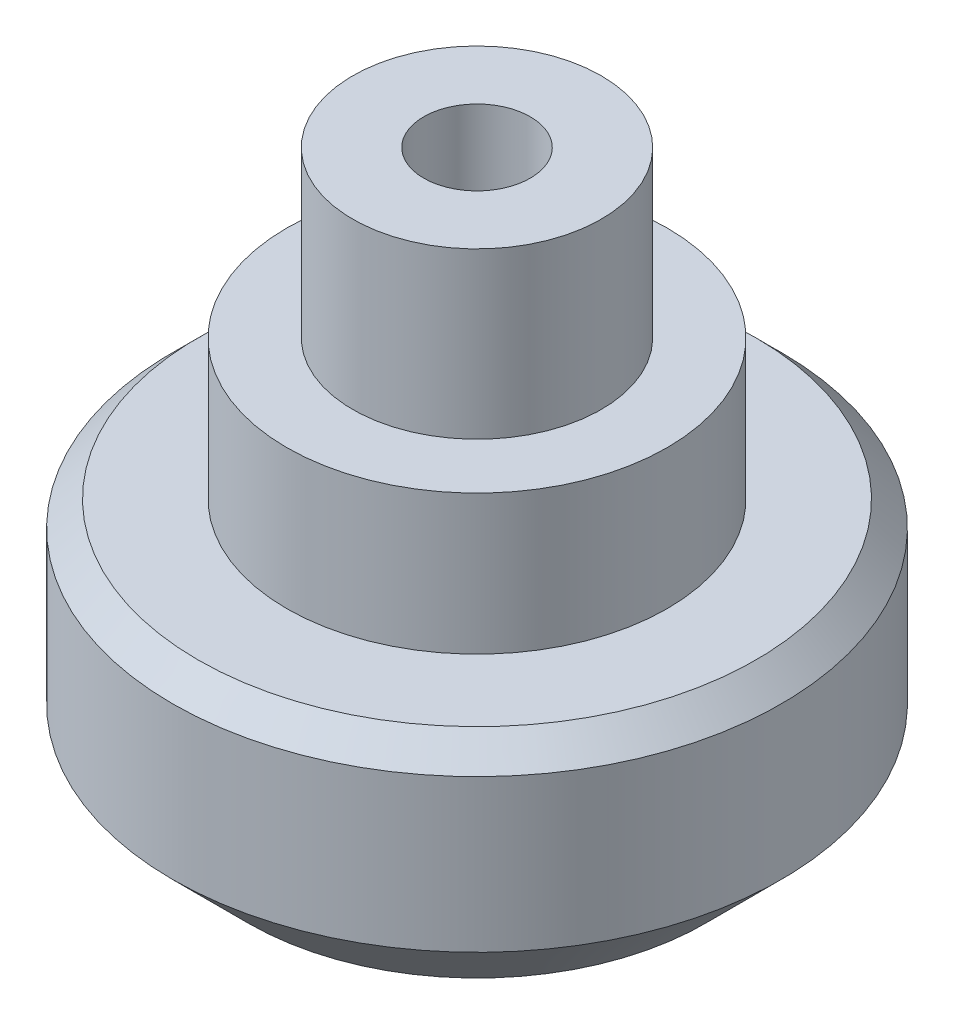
ISO-10303-21;
HEADER;
FILE_DESCRIPTION(('STEP AP214'),'2;1');
FILE_NAME('part.step','',(''),(''),'','','');
FILE_SCHEMA(('AUTOMOTIVE_DESIGN { 1 0 10303 214 1 1 1 1 }'));
ENDSEC;
DATA;
#1=APPLICATION_CONTEXT('core data for automotive mechanical design processes');
#2=APPLICATION_PROTOCOL_DEFINITION('international standard','automotive_design',2000,#1);
#3=PRODUCT_CONTEXT('',#1,'mechanical');
#4=PRODUCT('Part','Part','',(#3));
#5=PRODUCT_RELATED_PRODUCT_CATEGORY('part','',(#4));
#6=PRODUCT_DEFINITION_FORMATION('','',#4);
#7=PRODUCT_DEFINITION_CONTEXT('part definition',#1,'design');
#8=PRODUCT_DEFINITION('design','',#6,#7);
#9=PRODUCT_DEFINITION_SHAPE('','',#8);
#10=(LENGTH_UNIT() NAMED_UNIT(*) SI_UNIT(.MILLI.,.METRE.));
#11=(NAMED_UNIT(*) PLANE_ANGLE_UNIT() SI_UNIT($,.RADIAN.));
#12=(NAMED_UNIT(*) SI_UNIT($,.STERADIAN.) SOLID_ANGLE_UNIT());
#13=UNCERTAINTY_MEASURE_WITH_UNIT(LENGTH_MEASURE(1.E-05),#10,'distance_accuracy_value','');
#14=(GEOMETRIC_REPRESENTATION_CONTEXT(3) GLOBAL_UNCERTAINTY_ASSIGNED_CONTEXT((#13)) GLOBAL_UNIT_ASSIGNED_CONTEXT((#10,
#11,#12)) REPRESENTATION_CONTEXT('',''));
#15=CARTESIAN_POINT('',(0.,0.,0.));
#16=DIRECTION('',(0.,0.,1.));
#17=DIRECTION('',(1.,0.,0.));
#18=AXIS2_PLACEMENT_3D('',#15,#16,#17);
#19=CARTESIAN_POINT('',(0.,15.5,0.));
#20=DIRECTION('',(0.,1.,0.));
#21=DIRECTION('',(0.,0.,1.));
#22=AXIS2_PLACEMENT_3D('',#19,#20,#21);
#23=PLANE('',#22);
#24=CARTESIAN_POINT('',(0.,15.5,0.));
#25=DIRECTION('',(0.,1.,0.));
#26=DIRECTION('',(0.,0.,1.));
#27=AXIS2_PLACEMENT_3D('',#24,#25,#26);
#28=CIRCLE('',#27,7.5);
#29=CARTESIAN_POINT('',(0.,15.5,7.5));
#30=VERTEX_POINT('',#29);
#31=EDGE_CURVE('E48',#30,#30,#28,.T.);
#32=ORIENTED_EDGE('',*,*,#31,.T.);
#33=EDGE_LOOP('',(#32));
#34=FACE_BOUND('',#33,.T.);
#35=CARTESIAN_POINT('',(0.,15.5,0.));
#36=DIRECTION('',(0.,1.,0.));
#37=DIRECTION('',(0.,0.,1.));
#38=AXIS2_PLACEMENT_3D('',#35,#36,#37);
#39=CIRCLE('',#38,4.9);
#40=CARTESIAN_POINT('',(0.,15.5,-4.9));
#41=VERTEX_POINT('',#40);
#42=EDGE_CURVE('E55',#41,#41,#39,.T.);
#43=ORIENTED_EDGE('',*,*,#42,.F.);
#44=EDGE_LOOP('',(#43));
#45=FACE_BOUND('',#44,.T.);
#46=ADVANCED_FACE('F28',(#34,#45),#23,.T.);
#47=CARTESIAN_POINT('',(0.,10.,0.));
#48=DIRECTION('',(0.,1.,0.));
#49=DIRECTION('',(0.,0.,1.));
#50=AXIS2_PLACEMENT_3D('',#47,#48,#49);
#51=PLANE('',#50);
#52=CARTESIAN_POINT('',(0.,10.,0.));
#53=DIRECTION('',(0.,1.,0.));
#54=DIRECTION('',(0.,0.,1.));
#55=AXIS2_PLACEMENT_3D('',#52,#53,#54);
#56=CIRCLE('',#55,11.);
#57=CARTESIAN_POINT('',(0.,10.,11.));
#58=VERTEX_POINT('',#57);
#59=EDGE_CURVE('E43',#58,#58,#56,.T.);
#60=ORIENTED_EDGE('',*,*,#59,.T.);
#61=EDGE_LOOP('',(#60));
#62=FACE_BOUND('',#61,.T.);
#63=CARTESIAN_POINT('',(0.,10.,0.));
#64=DIRECTION('',(0.,1.,0.));
#65=DIRECTION('',(0.,0.,1.));
#66=AXIS2_PLACEMENT_3D('',#63,#64,#65);
#67=CIRCLE('',#66,7.5);
#68=CARTESIAN_POINT('',(0.,10.,7.5));
#69=VERTEX_POINT('',#68);
#70=EDGE_CURVE('E49',#69,#69,#67,.T.);
#71=ORIENTED_EDGE('',*,*,#70,.F.);
#72=EDGE_LOOP('',(#71));
#73=FACE_BOUND('',#72,.T.);
#74=ADVANCED_FACE('F95',(#62,#73),#51,.T.);
#75=CARTESIAN_POINT('',(0.,10.,0.));
#76=DIRECTION('',(0.,-1.,0.));
#77=DIRECTION('',(0.,0.,-1.));
#78=AXIS2_PLACEMENT_3D('',#75,#76,#77);
#79=CYLINDRICAL_SURFACE('',#78,12.);
#80=CARTESIAN_POINT('',(0.,3.,0.));
#81=DIRECTION('',(0.,1.,0.));
#82=DIRECTION('',(0.,0.,1.));
#83=AXIS2_PLACEMENT_3D('',#80,#81,#82);
#84=CIRCLE('',#83,12.);
#85=CARTESIAN_POINT('',(0.,3.,12.));
#86=VERTEX_POINT('',#85);
#87=EDGE_CURVE('E35',#86,#86,#84,.T.);
#88=ORIENTED_EDGE('',*,*,#87,.T.);
#89=EDGE_LOOP('',(#88));
#90=FACE_BOUND('',#89,.T.);
#91=CARTESIAN_POINT('',(0.,9.,0.));
#92=DIRECTION('',(0.,1.,0.));
#93=DIRECTION('',(0.,0.,1.));
#94=AXIS2_PLACEMENT_3D('',#91,#92,#93);
#95=CIRCLE('',#94,12.);
#96=CARTESIAN_POINT('',(0.,9.,12.));
#97=VERTEX_POINT('',#96);
#98=EDGE_CURVE('E39',#97,#97,#95,.F.);
#99=ORIENTED_EDGE('',*,*,#98,.T.);
#100=EDGE_LOOP('',(#99));
#101=FACE_BOUND('',#100,.T.);
#102=ADVANCED_FACE('F86',(#90,#101),#79,.T.);
#103=CARTESIAN_POINT('',(0.,0.,0.));
#104=DIRECTION('',(0.,1.,0.));
#105=DIRECTION('',(0.,0.,1.));
#106=AXIS2_PLACEMENT_3D('',#103,#104,#105);
#107=PLANE('',#106);
#108=CARTESIAN_POINT('',(0.,0.,0.));
#109=DIRECTION('',(0.,1.,0.));
#110=DIRECTION('',(0.,0.,1.));
#111=AXIS2_PLACEMENT_3D('',#108,#109,#110);
#112=CIRCLE('',#111,9.);
#113=CARTESIAN_POINT('',(0.,0.,9.));
#114=VERTEX_POINT('',#113);
#115=EDGE_CURVE('E10',#114,#114,#112,.F.);
#116=ORIENTED_EDGE('',*,*,#115,.T.);
#117=EDGE_LOOP('',(#116));
#118=FACE_BOUND('',#117,.T.);
#119=CARTESIAN_POINT('',(0.,0.,0.));
#120=DIRECTION('',(0.,-1.,0.));
#121=DIRECTION('',(0.,0.,-1.));
#122=AXIS2_PLACEMENT_3D('',#119,#120,#121);
#123=CIRCLE('',#122,2.5);
#124=CARTESIAN_POINT('',(0.,0.,-2.5));
#125=VERTEX_POINT('',#124);
#126=EDGE_CURVE('E67',#125,#125,#123,.T.);
#127=ORIENTED_EDGE('',*,*,#126,.F.);
#128=EDGE_LOOP('',(#127));
#129=FACE_BOUND('',#128,.T.);
#130=ADVANCED_FACE('F83',(#118,#129),#107,.F.);
#131=CARTESIAN_POINT('',(0.,15.5,0.));
#132=DIRECTION('',(0.,-1.,0.));
#133=DIRECTION('',(0.,0.,-1.));
#134=AXIS2_PLACEMENT_3D('',#131,#132,#133);
#135=CYLINDRICAL_SURFACE('',#134,7.5);
#136=ORIENTED_EDGE('',*,*,#31,.F.);
#137=EDGE_LOOP('',(#136));
#138=FACE_BOUND('',#137,.T.);
#139=ORIENTED_EDGE('',*,*,#70,.T.);
#140=EDGE_LOOP('',(#139));
#141=FACE_BOUND('',#140,.T.);
#142=ADVANCED_FACE('F85',(#138,#141),#135,.T.);
#143=CARTESIAN_POINT('',(0.,22.,0.));
#144=DIRECTION('',(0.,-1.,0.));
#145=DIRECTION('',(0.,0.,-1.));
#146=AXIS2_PLACEMENT_3D('',#143,#144,#145);
#147=CYLINDRICAL_SURFACE('',#146,4.9);
#148=CARTESIAN_POINT('',(0.,22.,0.));
#149=DIRECTION('',(0.,1.,0.));
#150=DIRECTION('',(0.,0.,1.));
#151=AXIS2_PLACEMENT_3D('',#148,#149,#150);
#152=CIRCLE('',#151,4.9);
#153=CARTESIAN_POINT('',(0.,22.,-4.9));
#154=VERTEX_POINT('',#153);
#155=EDGE_CURVE('E52',#154,#154,#152,.T.);
#156=CARTESIAN_POINT('',(0.,22.,-4.9));
#157=CARTESIAN_POINT('',(0.,21.9322916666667,-4.9));
#158=CARTESIAN_POINT('',(0.,21.8645833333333,-4.9));
#159=CARTESIAN_POINT('',(0.,21.7291666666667,-4.9));
#160=CARTESIAN_POINT('',(0.,21.6614583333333,-4.9));
#161=CARTESIAN_POINT('',(0.,21.5260416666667,-4.9));
#162=CARTESIAN_POINT('',(0.,21.4583333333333,-4.9));
#163=CARTESIAN_POINT('',(0.,21.3229166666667,-4.9));
#164=CARTESIAN_POINT('',(0.,21.2552083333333,-4.9));
#165=CARTESIAN_POINT('',(0.,21.1197916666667,-4.9));
#166=CARTESIAN_POINT('',(0.,21.0520833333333,-4.9));
#167=CARTESIAN_POINT('',(0.,20.9166666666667,-4.9));
#168=CARTESIAN_POINT('',(0.,20.8489583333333,-4.9));
#169=CARTESIAN_POINT('',(0.,20.7135416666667,-4.9));
#170=CARTESIAN_POINT('',(0.,20.6458333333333,-4.9));
#171=CARTESIAN_POINT('',(0.,20.5104166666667,-4.9));
#172=CARTESIAN_POINT('',(0.,20.4427083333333,-4.9));
#173=CARTESIAN_POINT('',(0.,20.3072916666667,-4.9));
#174=CARTESIAN_POINT('',(0.,20.2395833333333,-4.9));
#175=CARTESIAN_POINT('',(0.,20.1041666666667,-4.9));
#176=CARTESIAN_POINT('',(0.,20.0364583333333,-4.9));
#177=CARTESIAN_POINT('',(0.,19.9010416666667,-4.9));
#178=CARTESIAN_POINT('',(0.,19.8333333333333,-4.9));
#179=CARTESIAN_POINT('',(0.,19.6979166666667,-4.9));
#180=CARTESIAN_POINT('',(0.,19.6302083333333,-4.9));
#181=CARTESIAN_POINT('',(0.,19.4947916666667,-4.9));
#182=CARTESIAN_POINT('',(0.,19.4270833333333,-4.9));
#183=CARTESIAN_POINT('',(0.,19.2916666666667,-4.9));
#184=CARTESIAN_POINT('',(0.,19.2239583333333,-4.9));
#185=CARTESIAN_POINT('',(0.,19.0885416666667,-4.9));
#186=CARTESIAN_POINT('',(0.,19.0208333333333,-4.9));
#187=CARTESIAN_POINT('',(0.,18.8854166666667,-4.9));
#188=CARTESIAN_POINT('',(0.,18.8177083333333,-4.9));
#189=CARTESIAN_POINT('',(0.,18.6822916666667,-4.9));
#190=CARTESIAN_POINT('',(0.,18.6145833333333,-4.9));
#191=CARTESIAN_POINT('',(0.,18.4791666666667,-4.9));
#192=CARTESIAN_POINT('',(0.,18.4114583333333,-4.9));
#193=CARTESIAN_POINT('',(0.,18.2760416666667,-4.9));
#194=CARTESIAN_POINT('',(0.,18.2083333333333,-4.9));
#195=CARTESIAN_POINT('',(0.,18.0729166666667,-4.9));
#196=CARTESIAN_POINT('',(0.,18.0052083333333,-4.9));
#197=CARTESIAN_POINT('',(0.,17.8697916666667,-4.9));
#198=CARTESIAN_POINT('',(0.,17.8020833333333,-4.9));
#199=CARTESIAN_POINT('',(0.,17.6666666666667,-4.9));
#200=CARTESIAN_POINT('',(0.,17.5989583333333,-4.9));
#201=CARTESIAN_POINT('',(0.,17.4635416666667,-4.9));
#202=CARTESIAN_POINT('',(0.,17.3958333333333,-4.9));
#203=CARTESIAN_POINT('',(0.,17.2604166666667,-4.9));
#204=CARTESIAN_POINT('',(0.,17.1927083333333,-4.9));
#205=CARTESIAN_POINT('',(0.,17.0572916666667,-4.9));
#206=CARTESIAN_POINT('',(0.,16.9895833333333,-4.9));
#207=CARTESIAN_POINT('',(0.,16.8541666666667,-4.9));
#208=CARTESIAN_POINT('',(0.,16.7864583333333,-4.9));
#209=CARTESIAN_POINT('',(0.,16.6510416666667,-4.9));
#210=CARTESIAN_POINT('',(0.,16.5833333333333,-4.9));
#211=CARTESIAN_POINT('',(0.,16.4479166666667,-4.9));
#212=CARTESIAN_POINT('',(0.,16.3802083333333,-4.9));
#213=CARTESIAN_POINT('',(0.,16.2447916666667,-4.9));
#214=CARTESIAN_POINT('',(0.,16.1770833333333,-4.9));
#215=CARTESIAN_POINT('',(0.,16.0416666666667,-4.9));
#216=CARTESIAN_POINT('',(0.,15.9739583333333,-4.9));
#217=CARTESIAN_POINT('',(0.,15.8385416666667,-4.9));
#218=CARTESIAN_POINT('',(0.,15.7708333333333,-4.9));
#219=CARTESIAN_POINT('',(0.,15.6354166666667,-4.9));
#220=CARTESIAN_POINT('',(0.,15.5677083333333,-4.9));
#221=CARTESIAN_POINT('',(0.,15.5,-4.9));
#222=B_SPLINE_CURVE_WITH_KNOTS('',3,(#156,#157,#158,#159,#160,#161,#162,#163,#164,#165,#166,
#167,#168,#169,#170,#171,#172,#173,#174,#175,#176,#177,#178,#179,#180,#181,#182,#183,#184,#185,
#186,#187,#188,#189,#190,#191,#192,#193,#194,#195,#196,#197,#198,#199,#200,#201,#202,#203,#204,
#205,#206,#207,#208,#209,#210,#211,#212,#213,#214,#215,#216,#217,#218,#219,#220,#221),
.UNSPECIFIED.,.F.,.F.,(4,2,2,2,2,2,2,2,2,2,2,2,2,2,2,2,2,2,2,2,2,2,2,2,2,2,2,2,2,2,2,2,4),(0.,
0.203124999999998,0.406249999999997,0.609374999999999,0.812499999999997,1.015625,1.21875,
1.421875,1.625,1.828125,2.03125,2.234375,2.4375,2.640625,2.84375,3.046875,3.25,3.453125,3.65625,
3.859375,4.0625,4.265625,4.46875,4.671875,4.875,5.078125,5.28125,5.484375,5.68749999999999,
5.890625,6.09374999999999,6.296875,6.5),.UNSPECIFIED.);
#223=EDGE_CURVE('BSEAM92',#154,#41,#222,.T.);
#224=ORIENTED_EDGE('',*,*,#155,.F.);
#225=ORIENTED_EDGE('',*,*,#42,.T.);
#226=ORIENTED_EDGE('',*,*,#223,.T.);
#227=ORIENTED_EDGE('',*,*,#223,.F.);
#228=EDGE_LOOP('',(#224,#226,#225,#227));
#229=FACE_BOUND('',#228,.T.);
#230=ADVANCED_FACE('F92',(#229),#147,.T.);
#231=CARTESIAN_POINT('',(0.,22.,0.));
#232=DIRECTION('',(0.,1.,0.));
#233=DIRECTION('',(0.,0.,1.));
#234=AXIS2_PLACEMENT_3D('',#231,#232,#233);
#235=PLANE('',#234);
#236=CARTESIAN_POINT('',(0.,22.,0.));
#237=DIRECTION('',(0.,1.,0.));
#238=DIRECTION('',(0.,0.,1.));
#239=AXIS2_PLACEMENT_3D('',#236,#237,#238);
#240=CIRCLE('',#239,2.1);
#241=CARTESIAN_POINT('',(0.,22.,2.1));
#242=VERTEX_POINT('',#241);
#243=EDGE_CURVE('E58',#242,#242,#240,.T.);
#244=ORIENTED_EDGE('',*,*,#243,.F.);
#245=EDGE_LOOP('',(#244));
#246=FACE_BOUND('',#245,.T.);
#247=ORIENTED_EDGE('',*,*,#155,.T.);
#248=EDGE_LOOP('',(#247));
#249=FACE_BOUND('',#248,.T.);
#250=ADVANCED_FACE('F109',(#246,#249),#235,.T.);
#251=CARTESIAN_POINT('',(0.,10.,0.));
#252=DIRECTION('',(0.,1.,0.));
#253=DIRECTION('',(0.,0.,1.));
#254=AXIS2_PLACEMENT_3D('',#251,#252,#253);
#255=CYLINDRICAL_SURFACE('',#254,2.1);
#256=CARTESIAN_POINT('',(0.,10.,0.));
#257=DIRECTION('',(0.,-1.,0.));
#258=DIRECTION('',(0.,0.,-1.));
#259=AXIS2_PLACEMENT_3D('',#256,#257,#258);
#260=CIRCLE('',#259,2.1);
#261=CARTESIAN_POINT('',(0.,10.,-2.1));
#262=VERTEX_POINT('',#261);
#263=EDGE_CURVE('E63',#262,#262,#260,.F.);
#264=ORIENTED_EDGE('',*,*,#263,.F.);
#265=EDGE_LOOP('',(#264));
#266=FACE_BOUND('',#265,.T.);
#267=ORIENTED_EDGE('',*,*,#243,.T.);
#268=EDGE_LOOP('',(#267));
#269=FACE_BOUND('',#268,.T.);
#270=ADVANCED_FACE('F113',(#266,#269),#255,.F.);
#271=CARTESIAN_POINT('',(0.,10.,0.));
#272=DIRECTION('',(0.,-1.,0.));
#273=DIRECTION('',(0.,0.,-1.));
#274=AXIS2_PLACEMENT_3D('',#271,#272,#273);
#275=PLANE('',#274);
#276=CARTESIAN_POINT('',(0.,10.,0.));
#277=DIRECTION('',(0.,-1.,0.));
#278=DIRECTION('',(0.,0.,-1.));
#279=AXIS2_PLACEMENT_3D('',#276,#277,#278);
#280=CIRCLE('',#279,2.5);
#281=CARTESIAN_POINT('',(0.,10.,-2.5));
#282=VERTEX_POINT('',#281);
#283=EDGE_CURVE('E66',#282,#282,#280,.T.);
#284=ORIENTED_EDGE('',*,*,#283,.T.);
#285=EDGE_LOOP('',(#284));
#286=FACE_BOUND('',#285,.T.);
#287=ORIENTED_EDGE('',*,*,#263,.T.);
#288=EDGE_LOOP('',(#287));
#289=FACE_BOUND('',#288,.T.);
#290=ADVANCED_FACE('F73',(#286,#289),#275,.T.);
#291=CARTESIAN_POINT('',(0.,10.,0.));
#292=DIRECTION('',(0.,-1.,0.));
#293=DIRECTION('',(0.,0.,-1.));
#294=AXIS2_PLACEMENT_3D('',#291,#292,#293);
#295=CYLINDRICAL_SURFACE('',#294,2.5);
#296=ORIENTED_EDGE('',*,*,#283,.F.);
#297=EDGE_LOOP('',(#296));
#298=FACE_BOUND('',#297,.T.);
#299=ORIENTED_EDGE('',*,*,#126,.T.);
#300=EDGE_LOOP('',(#299));
#301=FACE_BOUND('',#300,.T.);
#302=ADVANCED_FACE('F76',(#298,#301),#295,.F.);
#303=CARTESIAN_POINT('',(0.,10.,0.));
#304=DIRECTION('',(0.,-1.,0.));
#305=DIRECTION('',(0.,0.,-1.));
#306=AXIS2_PLACEMENT_3D('',#303,#304,#305);
#307=CONICAL_SURFACE('',#306,11.,0.785398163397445);
#308=ORIENTED_EDGE('',*,*,#98,.F.);
#309=EDGE_LOOP('',(#308));
#310=FACE_BOUND('',#309,.T.);
#311=ORIENTED_EDGE('',*,*,#59,.F.);
#312=EDGE_LOOP('',(#311));
#313=FACE_BOUND('',#312,.T.);
#314=ADVANCED_FACE('F79',(#310,#313),#307,.T.);
#315=CARTESIAN_POINT('',(0.,3.,0.));
#316=DIRECTION('',(0.,1.,0.));
#317=DIRECTION('',(0.,0.,1.));
#318=AXIS2_PLACEMENT_3D('',#315,#316,#317);
#319=CONICAL_SURFACE('',#318,12.,0.78539816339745);
#320=ORIENTED_EDGE('',*,*,#115,.F.);
#321=EDGE_LOOP('',(#320));
#322=FACE_BOUND('',#321,.T.);
#323=ORIENTED_EDGE('',*,*,#87,.F.);
#324=EDGE_LOOP('',(#323));
#325=FACE_BOUND('',#324,.T.);
#326=ADVANCED_FACE('F30',(#322,#325),#319,.T.);
#327=CLOSED_SHELL('',(#46,#74,#102,#130,#142,#230,#250,#270,#290,#302,#314,#326));
#328=MANIFOLD_SOLID_BREP('B2',#327);
#329=ADVANCED_BREP_SHAPE_REPRESENTATION('',(#18,#328),#14);
#330=SHAPE_DEFINITION_REPRESENTATION(#9,#329);
ENDSEC;
END-ISO-10303-21;
